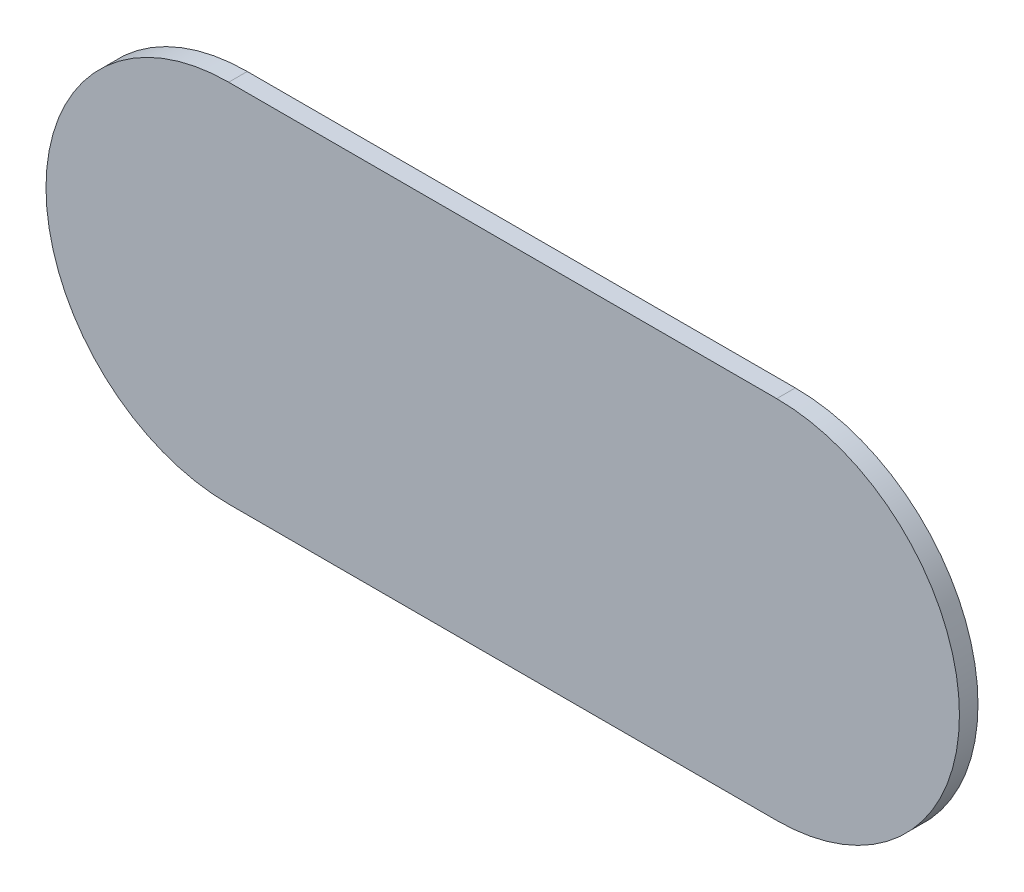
ISO-10303-21;
HEADER;
FILE_DESCRIPTION(('STEP AP214'),'2;1');
FILE_NAME('part.step','',(''),(''),'','','');
FILE_SCHEMA(('AUTOMOTIVE_DESIGN { 1 0 10303 214 1 1 1 1 }'));
ENDSEC;
DATA;
#1=APPLICATION_CONTEXT('core data for automotive mechanical design processes');
#2=APPLICATION_PROTOCOL_DEFINITION('international standard','automotive_design',2000,#1);
#3=PRODUCT_CONTEXT('',#1,'mechanical');
#4=PRODUCT('Part','Part','',(#3));
#5=PRODUCT_RELATED_PRODUCT_CATEGORY('part','',(#4));
#6=PRODUCT_DEFINITION_FORMATION('','',#4);
#7=PRODUCT_DEFINITION_CONTEXT('part definition',#1,'design');
#8=PRODUCT_DEFINITION('design','',#6,#7);
#9=PRODUCT_DEFINITION_SHAPE('','',#8);
#10=(LENGTH_UNIT() NAMED_UNIT(*) SI_UNIT(.MILLI.,.METRE.));
#11=(NAMED_UNIT(*) PLANE_ANGLE_UNIT() SI_UNIT($,.RADIAN.));
#12=(NAMED_UNIT(*) SI_UNIT($,.STERADIAN.) SOLID_ANGLE_UNIT());
#13=UNCERTAINTY_MEASURE_WITH_UNIT(LENGTH_MEASURE(1.E-05),#10,'distance_accuracy_value','');
#14=(GEOMETRIC_REPRESENTATION_CONTEXT(3) GLOBAL_UNCERTAINTY_ASSIGNED_CONTEXT((#13)) GLOBAL_UNIT_ASSIGNED_CONTEXT((#10,
#11,#12)) REPRESENTATION_CONTEXT('',''));
#15=CARTESIAN_POINT('',(0.,0.,0.));
#16=DIRECTION('',(0.,0.,1.));
#17=DIRECTION('',(1.,0.,0.));
#18=AXIS2_PLACEMENT_3D('',#15,#16,#17);
#19=CARTESIAN_POINT('',(5.75,14.535,-0.03048));
#20=DIRECTION('',(0.,0.,1.));
#21=DIRECTION('',(0.,1.,0.));
#22=AXIS2_PLACEMENT_3D('',#19,#20,#21);
#23=CYLINDRICAL_SURFACE('',#22,0.3);
#24=CARTESIAN_POINT('',(5.75,14.535,0.));
#25=DIRECTION('',(0.,0.,-1.));
#26=DIRECTION('',(0.,1.,0.));
#27=AXIS2_PLACEMENT_3D('',#24,#25,#26);
#28=CIRCLE('',#27,0.3);
#29=CARTESIAN_POINT('',(5.75,14.835,0.));
#30=VERTEX_POINT('',#29);
#31=CARTESIAN_POINT('',(5.75,14.235,0.));
#32=VERTEX_POINT('',#31);
#33=EDGE_CURVE('E66',#30,#32,#28,.T.);
#34=ORIENTED_EDGE('',*,*,#33,.T.);
#35=DIRECTION('',(0.,0.,-1.));
#36=VECTOR('',#35,1.);
#37=CARTESIAN_POINT('',(5.75,14.235,-0.01524));
#38=LINE('',#37,#36);
#39=CARTESIAN_POINT('',(5.75,14.235,-0.03048));
#40=VERTEX_POINT('',#39);
#41=EDGE_CURVE('E59',#32,#40,#38,.T.);
#42=ORIENTED_EDGE('',*,*,#41,.T.);
#43=CARTESIAN_POINT('',(5.75,14.535,-0.03048));
#44=DIRECTION('',(0.,0.,-1.));
#45=DIRECTION('',(0.,1.,0.));
#46=AXIS2_PLACEMENT_3D('',#43,#44,#45);
#47=CIRCLE('',#46,0.3);
#48=CARTESIAN_POINT('',(5.75,14.835,-0.03048));
#49=VERTEX_POINT('',#48);
#50=EDGE_CURVE('E63',#49,#40,#47,.T.);
#51=ORIENTED_EDGE('',*,*,#50,.F.);
#52=DIRECTION('',(0.,0.,-1.));
#53=VECTOR('',#52,1.);
#54=CARTESIAN_POINT('',(5.75,14.835,-0.01524));
#55=LINE('',#54,#53);
#56=EDGE_CURVE('E11',#30,#49,#55,.T.);
#57=ORIENTED_EDGE('',*,*,#56,.F.);
#58=EDGE_LOOP('',(#34,#42,#51,#57));
#59=FACE_BOUND('',#58,.T.);
#60=ADVANCED_FACE('F17',(#59),#23,.T.);
#61=CARTESIAN_POINT('',(4.85,14.835,-0.03048));
#62=DIRECTION('',(0.,-1.,0.));
#63=DIRECTION('',(0.,0.,-1.));
#64=AXIS2_PLACEMENT_3D('',#61,#62,#63);
#65=PLANE('',#64);
#66=DIRECTION('',(1.,0.,0.));
#67=VECTOR('',#66,1.);
#68=CARTESIAN_POINT('',(5.3,14.835,0.));
#69=LINE('',#68,#67);
#70=CARTESIAN_POINT('',(4.85,14.835,0.));
#71=VERTEX_POINT('',#70);
#72=EDGE_CURVE('E93',#71,#30,#69,.T.);
#73=ORIENTED_EDGE('',*,*,#72,.T.);
#74=ORIENTED_EDGE('',*,*,#56,.T.);
#75=DIRECTION('',(1.,0.,0.));
#76=VECTOR('',#75,1.);
#77=CARTESIAN_POINT('',(4.85,14.835,-0.03048));
#78=LINE('',#77,#76);
#79=CARTESIAN_POINT('',(4.85,14.835,-0.03048));
#80=VERTEX_POINT('',#79);
#81=EDGE_CURVE('E82',#80,#49,#78,.T.);
#82=ORIENTED_EDGE('',*,*,#81,.F.);
#83=DIRECTION('',(0.,0.,-1.));
#84=VECTOR('',#83,1.);
#85=CARTESIAN_POINT('',(4.85,14.835,-0.01524));
#86=LINE('',#85,#84);
#87=EDGE_CURVE('E27',#71,#80,#86,.T.);
#88=ORIENTED_EDGE('',*,*,#87,.F.);
#89=EDGE_LOOP('',(#73,#74,#82,#88));
#90=FACE_BOUND('',#89,.T.);
#91=ADVANCED_FACE('F135',(#90),#65,.F.);
#92=CARTESIAN_POINT('',(4.85,14.535,-0.03048));
#93=DIRECTION('',(0.,0.,1.));
#94=DIRECTION('',(0.,-1.,0.));
#95=AXIS2_PLACEMENT_3D('',#92,#93,#94);
#96=CYLINDRICAL_SURFACE('',#95,0.3);
#97=CARTESIAN_POINT('',(4.85,14.535,0.));
#98=DIRECTION('',(0.,0.,-1.));
#99=DIRECTION('',(0.,-1.,0.));
#100=AXIS2_PLACEMENT_3D('',#97,#98,#99);
#101=CIRCLE('',#100,0.3);
#102=CARTESIAN_POINT('',(4.85,14.235,0.));
#103=VERTEX_POINT('',#102);
#104=EDGE_CURVE('E89',#103,#71,#101,.T.);
#105=ORIENTED_EDGE('',*,*,#104,.T.);
#106=ORIENTED_EDGE('',*,*,#87,.T.);
#107=CARTESIAN_POINT('',(4.85,14.535,-0.03048));
#108=DIRECTION('',(0.,0.,-1.));
#109=DIRECTION('',(0.,-1.,0.));
#110=AXIS2_PLACEMENT_3D('',#107,#108,#109);
#111=CIRCLE('',#110,0.3);
#112=CARTESIAN_POINT('',(4.85,14.235,-0.03048));
#113=VERTEX_POINT('',#112);
#114=EDGE_CURVE('E78',#113,#80,#111,.T.);
#115=ORIENTED_EDGE('',*,*,#114,.F.);
#116=DIRECTION('',(0.,0.,-1.));
#117=VECTOR('',#116,1.);
#118=CARTESIAN_POINT('',(4.85,14.235,-0.01524));
#119=LINE('',#118,#117);
#120=EDGE_CURVE('E71',#103,#113,#119,.T.);
#121=ORIENTED_EDGE('',*,*,#120,.F.);
#122=EDGE_LOOP('',(#105,#106,#115,#121));
#123=FACE_BOUND('',#122,.T.);
#124=ADVANCED_FACE('F19',(#123),#96,.T.);
#125=CARTESIAN_POINT('',(5.75,14.235,-0.03048));
#126=DIRECTION('',(0.,1.,0.));
#127=DIRECTION('',(1.,0.,0.));
#128=AXIS2_PLACEMENT_3D('',#125,#126,#127);
#129=PLANE('',#128);
#130=DIRECTION('',(-1.,0.,0.));
#131=VECTOR('',#130,1.);
#132=CARTESIAN_POINT('',(5.3,14.235,0.));
#133=LINE('',#132,#131);
#134=EDGE_CURVE('E84',#32,#103,#133,.T.);
#135=ORIENTED_EDGE('',*,*,#134,.T.);
#136=ORIENTED_EDGE('',*,*,#120,.T.);
#137=DIRECTION('',(-1.,0.,0.));
#138=VECTOR('',#137,1.);
#139=CARTESIAN_POINT('',(5.75,14.235,-0.03048));
#140=LINE('',#139,#138);
#141=EDGE_CURVE('E73',#40,#113,#140,.T.);
#142=ORIENTED_EDGE('',*,*,#141,.F.);
#143=ORIENTED_EDGE('',*,*,#41,.F.);
#144=EDGE_LOOP('',(#135,#136,#142,#143));
#145=FACE_BOUND('',#144,.T.);
#146=ADVANCED_FACE('F74',(#145),#129,.F.);
#147=CARTESIAN_POINT('',(5.3,14.535,-0.03048));
#148=DIRECTION('',(0.,0.,1.));
#149=DIRECTION('',(1.,0.,0.));
#150=AXIS2_PLACEMENT_3D('',#147,#148,#149);
#151=PLANE('',#150);
#152=ORIENTED_EDGE('',*,*,#50,.T.);
#153=ORIENTED_EDGE('',*,*,#141,.T.);
#154=ORIENTED_EDGE('',*,*,#114,.T.);
#155=ORIENTED_EDGE('',*,*,#81,.T.);
#156=EDGE_LOOP('',(#152,#153,#154,#155));
#157=FACE_BOUND('',#156,.T.);
#158=ADVANCED_FACE('F81',(#157),#151,.F.);
#159=CARTESIAN_POINT('',(5.3,14.535,0.));
#160=DIRECTION('',(0.,0.,1.));
#161=DIRECTION('',(1.,0.,0.));
#162=AXIS2_PLACEMENT_3D('',#159,#160,#161);
#163=PLANE('',#162);
#164=ORIENTED_EDGE('',*,*,#33,.F.);
#165=ORIENTED_EDGE('',*,*,#72,.F.);
#166=ORIENTED_EDGE('',*,*,#104,.F.);
#167=ORIENTED_EDGE('',*,*,#134,.F.);
#168=EDGE_LOOP('',(#164,#165,#166,#167));
#169=FACE_BOUND('',#168,.T.);
#170=ADVANCED_FACE('F113',(#169),#163,.T.);
#171=CLOSED_SHELL('',(#60,#91,#124,#146,#158,#170));
#172=MANIFOLD_SOLID_BREP('B1',#171);
#173=ADVANCED_BREP_SHAPE_REPRESENTATION('',(#18,#172),#14);
#174=SHAPE_DEFINITION_REPRESENTATION(#9,#173);
ENDSEC;
END-ISO-10303-21;
